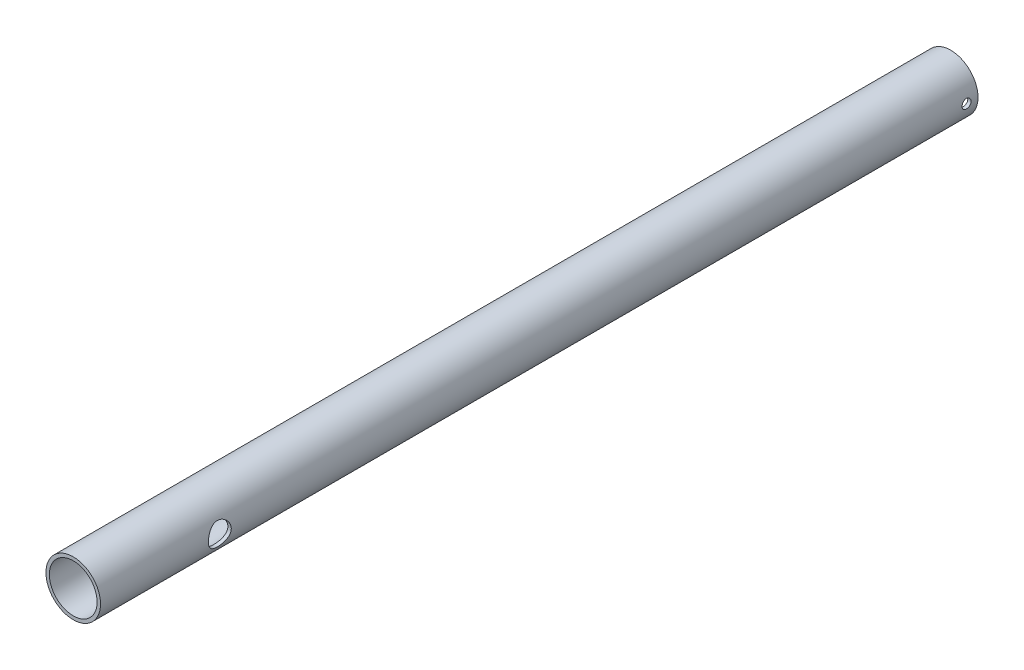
from build123d import *

# Parameters (mm, degrees)
ESQUISSE1_R             = 24
ESQUISSE1_R_2           = 21
EXTRUSION1_DEPTH        = 772
ESQUISSE2_R             = 10.05
ENL_V_MAT_EXTRU_1_DEPTH = 26
ESQUISSE3_R             = 4
ENL_V_MAT_EXTRU_2_DEPTH = 26


with BuildPart() as part:
    # Esquisse1 → Extrusion1 (new body)
    with BuildSketch(Plane.XY):
        Circle(ESQUISSE1_R)
        Circle(ESQUISSE1_R_2, mode=Mode.SUBTRACT)
    extrude(amount=EXTRUSION1_DEPTH)

    # Esquisse2 → Enl_v. mat.-Extru.1 (cut, symmetric)
    with BuildSketch(Plane(origin=(0, 0, 0), x_dir=(0, 0, -1), z_dir=(1, 0, 0))):
        with Locations((-667, 0)):
            Circle(ESQUISSE2_R)
    extrude(amount=ENL_V_MAT_EXTRU_1_DEPTH, both=True, mode=Mode.SUBTRACT)

    # Esquisse3 → Enl_v. mat.-Extru.2 (cut, symmetric)
    with BuildSketch(Plane(origin=(0, 0, 0), x_dir=(0, 0, -1), z_dir=(1, 0, 0))):
        with Locations((-10, 0)):
            Circle(ESQUISSE3_R)
    extrude(amount=ENL_V_MAT_EXTRU_2_DEPTH, both=True, mode=Mode.SUBTRACT)


solid = part.part
